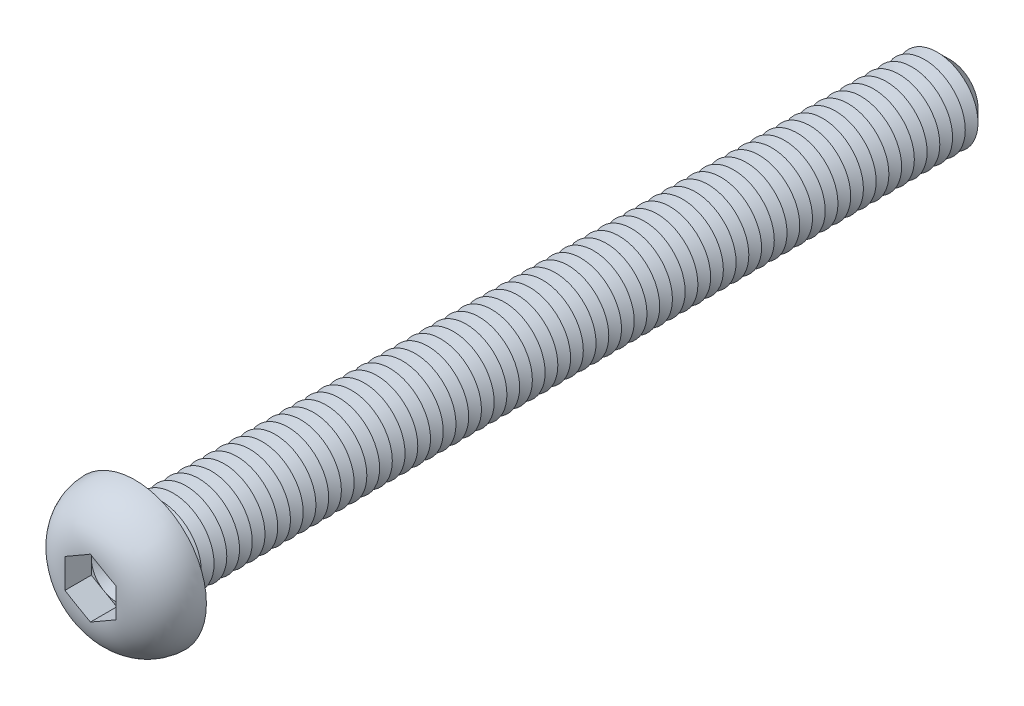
from build123d import *

# Parameters (mm, degrees)
CUT_EXTRUDE1_DEPTH  = 2.6
SKETCH4_R           = 4
BOSS_EXTRUDE1_DEPTH = 80
CHAMFER1_SIZE       = 1.25
LPATTERN1_COUNT     = 62
LPATTERN1_PITCH     = 1.25
FILLET2_R           = 0.5


with BuildPart() as part:
    # Sketch2 → Revolve1 (revolve)
    with BuildSketch(Plane(origin=(0, 0, 0), x_dir=(0, 0, -1), z_dir=(1, 0, 0)), mode=Mode.PRIVATE) as revolve1_sk:
        with BuildLine():
            Line((0, 0), (-4.4, 0))
            Line((-4.4, 0), (-4.4, 2.501111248))
            ThreePointArc((-4.4, 2.501111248), (-3.117141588, 5.647537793), (0, 7))
            Line((0, 7), (0, 0))
        make_face()
    revolve(revolve1_sk.sketch.rotate(Axis((0, 0, 47.934239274), (0, 0, -1)), 90), axis=Axis((0, 0, 47.934239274), (0, 0, -1)))

    # Sketch3 → Cut-Extrude1 (cut)
    with BuildSketch(Plane.XY.offset(4.4)):
        Polygon((0, 2.886751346), (-2.5, 1.443375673), (-2.5, -1.443375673), (0, -2.886751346), (2.5, -1.443375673), (2.5, 1.443375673), align=None)
    extrude(amount=-CUT_EXTRUDE1_DEPTH, mode=Mode.SUBTRACT)

    # Sketch4 → Boss-Extrude1 (add)
    with BuildSketch(Plane(origin=(0, 0, 0), x_dir=(-1, 0, 0), z_dir=(0, 0, -1))):
        with Locations(Location((0, 0, 0), (0, 0, 180))):
            Circle(SKETCH4_R)
    extrude(amount=BOSS_EXTRUDE1_DEPTH)

    # Chamfer1
    chamfer1_edges = [part.edges().sort_by_distance(p)[0] for p in [
        (-4, 0, -80),
    ]]
    chamfer(chamfer1_edges, length=CHAMFER1_SIZE)

    # Sketch5 → Cut-Revolve1 (revolve, cut)
    with BuildSketch(Plane(origin=(0, 0, 0), x_dir=(0, 0, -1), z_dir=(1, 0, 0)), mode=Mode.PRIVATE) as cut_revolve1_sk:
        Polygon((1.25, 4), (2.5, 4), (1.875, 2.917468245), align=None)
    cut_revolve1 = revolve(cut_revolve1_sk.sketch.rotate(Axis((0, 0, 47.934239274), (0, 0, -1)), 90), axis=Axis((0, 0, 47.934239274), (0, 0, -1)), mode=Mode.SUBTRACT)

    # LPattern1: Cut-Revolve1 ×62
    with Locations(*[(0, 0, -i * LPATTERN1_PITCH) for i in range(1, LPATTERN1_COUNT)]):
        add(cut_revolve1, mode=Mode.SUBTRACT)

    # Fillet2
    fillet2_edges = [part.edges().sort_by_distance(p)[0] for p in [
        (-4, 0, 0),
    ]]
    fillet(fillet2_edges, radius=FILLET2_R)

    # Cut-Extrude2 cone 1 section (on through the dimple's axis) → Cut-Extrude2 (revolve, cut)
    with BuildSketch(Plane(origin=(0, 0, 1.8), x_dir=(0, -1, 0), z_dir=(1, 0, 0))):
        Polygon((0, 0), (2.5, 0), (0, 1.443375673), align=None)
    revolve(axis=Axis((0, 0, 1.8), (0, 0, -1)), mode=Mode.SUBTRACT)


solid = part.part
